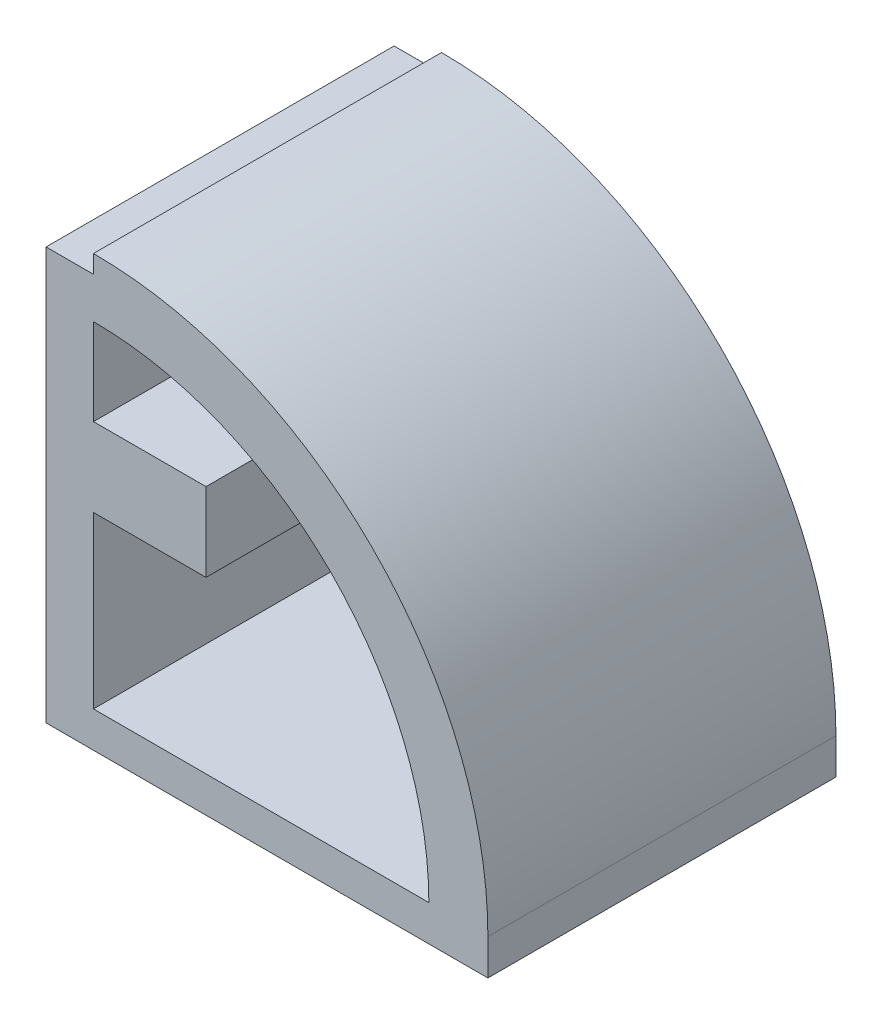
ISO-10303-21;
HEADER;
FILE_DESCRIPTION(('STEP AP214'),'2;1');
FILE_NAME('part.step','',(''),(''),'','','');
FILE_SCHEMA(('AUTOMOTIVE_DESIGN { 1 0 10303 214 1 1 1 1 }'));
ENDSEC;
DATA;
#1=APPLICATION_CONTEXT('core data for automotive mechanical design processes');
#2=APPLICATION_PROTOCOL_DEFINITION('international standard','automotive_design',2000,#1);
#3=PRODUCT_CONTEXT('',#1,'mechanical');
#4=PRODUCT('Part','Part','',(#3));
#5=PRODUCT_RELATED_PRODUCT_CATEGORY('part','',(#4));
#6=PRODUCT_DEFINITION_FORMATION('','',#4);
#7=PRODUCT_DEFINITION_CONTEXT('part definition',#1,'design');
#8=PRODUCT_DEFINITION('design','',#6,#7);
#9=PRODUCT_DEFINITION_SHAPE('','',#8);
#10=(LENGTH_UNIT() NAMED_UNIT(*) SI_UNIT(.MILLI.,.METRE.));
#11=(NAMED_UNIT(*) PLANE_ANGLE_UNIT() SI_UNIT($,.RADIAN.));
#12=(NAMED_UNIT(*) SI_UNIT($,.STERADIAN.) SOLID_ANGLE_UNIT());
#13=UNCERTAINTY_MEASURE_WITH_UNIT(LENGTH_MEASURE(1.E-05),#10,'distance_accuracy_value','');
#14=(GEOMETRIC_REPRESENTATION_CONTEXT(3) GLOBAL_UNCERTAINTY_ASSIGNED_CONTEXT((#13)) GLOBAL_UNIT_ASSIGNED_CONTEXT((#10,
#11,#12)) REPRESENTATION_CONTEXT('',''));
#15=CARTESIAN_POINT('',(0.,0.,0.));
#16=DIRECTION('',(0.,0.,1.));
#17=DIRECTION('',(1.,0.,0.));
#18=AXIS2_PLACEMENT_3D('',#15,#16,#17);
#19=CARTESIAN_POINT('',(18.1175022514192,13.684496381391,66.5));
#20=DIRECTION('',(-1.,0.,0.));
#21=DIRECTION('',(0.,0.,1.));
#22=AXIS2_PLACEMENT_3D('',#19,#20,#21);
#23=PLANE('',#22);
#24=DIRECTION('',(0.,0.,-1.));
#25=VECTOR('',#24,1.);
#26=CARTESIAN_POINT('',(18.1175022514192,141.846369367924,66.5));
#27=LINE('',#26,#25);
#28=CARTESIAN_POINT('',(18.1175022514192,141.846369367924,-66.5));
#29=VERTEX_POINT('',#28);
#30=CARTESIAN_POINT('',(18.1175022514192,141.846369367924,66.5));
#31=VERTEX_POINT('',#30);
#32=EDGE_CURVE('E48',#29,#31,#27,.F.);
#33=ORIENTED_EDGE('',*,*,#32,.T.);
#34=DIRECTION('',(0.,1.,0.));
#35=VECTOR('',#34,1.);
#36=CARTESIAN_POINT('',(18.1175022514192,13.684496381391,66.5));
#37=LINE('',#36,#35);
#38=CARTESIAN_POINT('',(18.1175022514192,108.761947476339,66.5));
#39=VERTEX_POINT('',#38);
#40=EDGE_CURVE('E204',#39,#31,#37,.T.);
#41=ORIENTED_EDGE('',*,*,#40,.F.);
#42=DIRECTION('',(0.,0.,1.));
#43=VECTOR('',#42,1.);
#44=CARTESIAN_POINT('',(18.1175022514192,108.761947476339,66.5));
#45=LINE('',#44,#43);
#46=CARTESIAN_POINT('',(18.1175022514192,108.761947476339,-66.5));
#47=VERTEX_POINT('',#46);
#48=EDGE_CURVE('E170',#47,#39,#45,.T.);
#49=ORIENTED_EDGE('',*,*,#48,.F.);
#50=DIRECTION('',(0.,1.,0.));
#51=VECTOR('',#50,1.);
#52=CARTESIAN_POINT('',(18.1175022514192,13.684496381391,-66.5));
#53=LINE('',#52,#51);
#54=EDGE_CURVE('E218',#47,#29,#53,.T.);
#55=ORIENTED_EDGE('',*,*,#54,.T.);
#56=EDGE_LOOP('',(#33,#41,#49,#55));
#57=FACE_BOUND('',#56,.T.);
#58=ADVANCED_FACE('F33',(#57),#23,.F.);
#59=CARTESIAN_POINT('',(168.839701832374,13.684496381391,66.5));
#60=DIRECTION('',(0.,-1.,0.));
#61=DIRECTION('',(0.,0.,-1.));
#62=AXIS2_PLACEMENT_3D('',#59,#60,#61);
#63=PLANE('',#62);
#64=DIRECTION('',(0.,0.,1.));
#65=VECTOR('',#64,1.);
#66=CARTESIAN_POINT('',(146.279375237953,13.684496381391,66.5));
#67=LINE('',#66,#65);
#68=CARTESIAN_POINT('',(146.279375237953,13.684496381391,-66.5));
#69=VERTEX_POINT('',#68);
#70=CARTESIAN_POINT('',(146.279375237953,13.684496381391,66.5));
#71=VERTEX_POINT('',#70);
#72=EDGE_CURVE('E140',#69,#71,#67,.T.);
#73=ORIENTED_EDGE('',*,*,#72,.F.);
#74=DIRECTION('',(-1.,0.,0.));
#75=VECTOR('',#74,1.);
#76=CARTESIAN_POINT('',(168.839701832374,13.684496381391,-66.5));
#77=LINE('',#76,#75);
#78=CARTESIAN_POINT('',(18.1175022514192,13.684496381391,-66.5));
#79=VERTEX_POINT('',#78);
#80=EDGE_CURVE('E216',#69,#79,#77,.T.);
#81=ORIENTED_EDGE('',*,*,#80,.T.);
#82=DIRECTION('',(0.,0.,-1.));
#83=VECTOR('',#82,1.);
#84=CARTESIAN_POINT('',(18.1175022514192,13.684496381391,66.5));
#85=LINE('',#84,#83);
#86=CARTESIAN_POINT('',(18.1175022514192,13.684496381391,66.5));
#87=VERTEX_POINT('',#86);
#88=EDGE_CURVE('E221',#87,#79,#85,.T.);
#89=ORIENTED_EDGE('',*,*,#88,.F.);
#90=DIRECTION('',(-1.,0.,0.));
#91=VECTOR('',#90,1.);
#92=CARTESIAN_POINT('',(168.839701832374,13.684496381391,66.5));
#93=LINE('',#92,#91);
#94=EDGE_CURVE('E56',#71,#87,#93,.T.);
#95=ORIENTED_EDGE('',*,*,#94,.F.);
#96=EDGE_LOOP('',(#73,#81,#89,#95));
#97=FACE_BOUND('',#96,.T.);
#98=ADVANCED_FACE('F359',(#97),#63,.F.);
#99=DIRECTION('',(0.,0.,-1.));
#100=VECTOR('',#99,1.);
#101=CARTESIAN_POINT('',(18.1175022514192,78.7188677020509,66.5));
#102=LINE('',#101,#100);
#103=CARTESIAN_POINT('',(18.1175022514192,78.7188677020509,66.5));
#104=VERTEX_POINT('',#103);
#105=CARTESIAN_POINT('',(18.1175022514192,78.7188677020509,-66.5));
#106=VERTEX_POINT('',#105);
#107=EDGE_CURVE('E177',#104,#106,#102,.T.);
#108=ORIENTED_EDGE('',*,*,#107,.F.);
#109=EDGE_CURVE('E205',#87,#104,#37,.T.);
#110=ORIENTED_EDGE('',*,*,#109,.F.);
#111=ORIENTED_EDGE('',*,*,#88,.T.);
#112=EDGE_CURVE('E197',#79,#106,#53,.T.);
#113=ORIENTED_EDGE('',*,*,#112,.T.);
#114=EDGE_LOOP('',(#108,#110,#111,#113));
#115=FACE_BOUND('',#114,.T.);
#116=ADVANCED_FACE('F353',(#115),#23,.F.);
#117=CARTESIAN_POINT('',(18.1175022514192,157.514311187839,66.5));
#118=DIRECTION('',(0.,-1.,0.));
#119=DIRECTION('',(0.,0.,-1.));
#120=AXIS2_PLACEMENT_3D('',#117,#118,#119);
#121=PLANE('',#120);
#122=DIRECTION('',(-1.,0.,0.));
#123=VECTOR('',#122,1.);
#124=CARTESIAN_POINT('',(18.1175022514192,157.514311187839,-66.5));
#125=LINE('',#124,#123);
#126=CARTESIAN_POINT('',(18.1175022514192,157.514311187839,-66.5));
#127=VERTEX_POINT('',#126);
#128=CARTESIAN_POINT('',(0.,157.514311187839,-66.5));
#129=VERTEX_POINT('',#128);
#130=EDGE_CURVE('E149',#127,#129,#125,.T.);
#131=ORIENTED_EDGE('',*,*,#130,.T.);
#132=DIRECTION('',(0.,0.,-1.));
#133=VECTOR('',#132,1.);
#134=CARTESIAN_POINT('',(0.,157.514311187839,66.5));
#135=LINE('',#134,#133);
#136=CARTESIAN_POINT('',(0.,157.514311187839,66.5));
#137=VERTEX_POINT('',#136);
#138=EDGE_CURVE('E12',#137,#129,#135,.T.);
#139=ORIENTED_EDGE('',*,*,#138,.F.);
#140=DIRECTION('',(-1.,0.,0.));
#141=VECTOR('',#140,1.);
#142=CARTESIAN_POINT('',(18.1175022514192,157.514311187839,66.5));
#143=LINE('',#142,#141);
#144=CARTESIAN_POINT('',(18.1175022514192,157.514311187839,66.5));
#145=VERTEX_POINT('',#144);
#146=EDGE_CURVE('E193',#145,#137,#143,.T.);
#147=ORIENTED_EDGE('',*,*,#146,.F.);
#148=DIRECTION('',(0.,0.,-1.));
#149=VECTOR('',#148,1.);
#150=CARTESIAN_POINT('',(18.1175022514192,157.514311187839,66.5));
#151=LINE('',#150,#149);
#152=EDGE_CURVE('E208',#145,#127,#151,.T.);
#153=ORIENTED_EDGE('',*,*,#152,.T.);
#154=EDGE_LOOP('',(#131,#139,#147,#153));
#155=FACE_BOUND('',#154,.T.);
#156=ADVANCED_FACE('F35',(#155),#121,.F.);
#157=CARTESIAN_POINT('',(0.,157.514311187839,66.5));
#158=DIRECTION('',(1.,0.,0.));
#159=DIRECTION('',(0.,0.,-1.));
#160=AXIS2_PLACEMENT_3D('',#157,#158,#159);
#161=PLANE('',#160);
#162=DIRECTION('',(0.,-1.,0.));
#163=VECTOR('',#162,1.);
#164=CARTESIAN_POINT('',(0.,157.514311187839,-66.5));
#165=LINE('',#164,#163);
#166=CARTESIAN_POINT('',(0.,0.,-66.5));
#167=VERTEX_POINT('',#166);
#168=EDGE_CURVE('E210',#129,#167,#165,.T.);
#169=ORIENTED_EDGE('',*,*,#168,.T.);
#170=DIRECTION('',(0.,0.,-1.));
#171=VECTOR('',#170,1.);
#172=CARTESIAN_POINT('',(0.,0.,66.5));
#173=LINE('',#172,#171);
#174=CARTESIAN_POINT('',(0.,0.,66.5));
#175=VERTEX_POINT('',#174);
#176=EDGE_CURVE('E41',#175,#167,#173,.T.);
#177=ORIENTED_EDGE('',*,*,#176,.F.);
#178=DIRECTION('',(0.,-1.,0.));
#179=VECTOR('',#178,1.);
#180=CARTESIAN_POINT('',(0.,157.514311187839,66.5));
#181=LINE('',#180,#179);
#182=EDGE_CURVE('E196',#137,#175,#181,.T.);
#183=ORIENTED_EDGE('',*,*,#182,.F.);
#184=ORIENTED_EDGE('',*,*,#138,.T.);
#185=EDGE_LOOP('',(#169,#177,#183,#184));
#186=FACE_BOUND('',#185,.T.);
#187=ADVANCED_FACE('F241',(#186),#161,.F.);
#188=CARTESIAN_POINT('',(0.,0.,66.5));
#189=DIRECTION('',(0.,1.,0.));
#190=DIRECTION('',(0.,0.,1.));
#191=AXIS2_PLACEMENT_3D('',#188,#189,#190);
#192=PLANE('',#191);
#193=DIRECTION('',(1.,0.,0.));
#194=VECTOR('',#193,1.);
#195=CARTESIAN_POINT('',(0.,0.,-66.5));
#196=LINE('',#195,#194);
#197=CARTESIAN_POINT('',(168.839701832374,0.,-66.5));
#198=VERTEX_POINT('',#197);
#199=EDGE_CURVE('E212',#167,#198,#196,.T.);
#200=ORIENTED_EDGE('',*,*,#199,.T.);
#201=DIRECTION('',(0.,0.,-1.));
#202=VECTOR('',#201,1.);
#203=CARTESIAN_POINT('',(168.839701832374,0.,66.5));
#204=LINE('',#203,#202);
#205=CARTESIAN_POINT('',(168.839701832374,0.,66.5));
#206=VERTEX_POINT('',#205);
#207=EDGE_CURVE('E225',#206,#198,#204,.T.);
#208=ORIENTED_EDGE('',*,*,#207,.F.);
#209=DIRECTION('',(1.,0.,0.));
#210=VECTOR('',#209,1.);
#211=CARTESIAN_POINT('',(0.,0.,66.5));
#212=LINE('',#211,#210);
#213=EDGE_CURVE('E199',#175,#206,#212,.T.);
#214=ORIENTED_EDGE('',*,*,#213,.F.);
#215=ORIENTED_EDGE('',*,*,#176,.T.);
#216=EDGE_LOOP('',(#200,#208,#214,#215));
#217=FACE_BOUND('',#216,.T.);
#218=ADVANCED_FACE('F232',(#217),#192,.F.);
#219=CARTESIAN_POINT('',(168.839701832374,0.,66.5));
#220=DIRECTION('',(-1.,0.,0.));
#221=DIRECTION('',(0.,0.,1.));
#222=AXIS2_PLACEMENT_3D('',#219,#220,#221);
#223=PLANE('',#222);
#224=DIRECTION('',(0.,1.,0.));
#225=VECTOR('',#224,1.);
#226=CARTESIAN_POINT('',(168.839701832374,0.,-66.5));
#227=LINE('',#226,#225);
#228=CARTESIAN_POINT('',(168.839701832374,13.684496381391,-66.5));
#229=VERTEX_POINT('',#228);
#230=EDGE_CURVE('E214',#198,#229,#227,.T.);
#231=ORIENTED_EDGE('',*,*,#230,.T.);
#232=DIRECTION('',(0.,0.,-1.));
#233=VECTOR('',#232,1.);
#234=CARTESIAN_POINT('',(168.839701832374,13.684496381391,66.5));
#235=LINE('',#234,#233);
#236=CARTESIAN_POINT('',(168.839701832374,13.684496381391,66.5));
#237=VERTEX_POINT('',#236);
#238=EDGE_CURVE('E154',#237,#229,#235,.T.);
#239=ORIENTED_EDGE('',*,*,#238,.F.);
#240=DIRECTION('',(0.,1.,0.));
#241=VECTOR('',#240,1.);
#242=CARTESIAN_POINT('',(168.839701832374,0.,66.5));
#243=LINE('',#242,#241);
#244=EDGE_CURVE('E201',#206,#237,#243,.T.);
#245=ORIENTED_EDGE('',*,*,#244,.F.);
#246=ORIENTED_EDGE('',*,*,#207,.T.);
#247=EDGE_LOOP('',(#231,#239,#245,#246));
#248=FACE_BOUND('',#247,.T.);
#249=ADVANCED_FACE('F236',(#248),#223,.F.);
#250=CARTESIAN_POINT('',(0.,157.514311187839,66.5));
#251=DIRECTION('',(0.,0.,1.));
#252=DIRECTION('',(1.,0.,0.));
#253=AXIS2_PLACEMENT_3D('',#250,#251,#252);
#254=PLANE('',#253);
#255=CARTESIAN_POINT('',(18.1175022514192,13.684496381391,66.5));
#256=DIRECTION('',(0.,0.,-1.));
#257=DIRECTION('',(-1.,0.,0.));
#258=AXIS2_PLACEMENT_3D('',#255,#256,#257);
#259=CIRCLE('',#258,128.161872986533);
#260=EDGE_CURVE('E155',#31,#71,#259,.T.);
#261=ORIENTED_EDGE('',*,*,#260,.T.);
#262=ORIENTED_EDGE('',*,*,#94,.T.);
#263=ORIENTED_EDGE('',*,*,#109,.T.);
#264=DIRECTION('',(-1.,0.,0.));
#265=VECTOR('',#264,1.);
#266=CARTESIAN_POINT('',(61.1175022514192,78.7188677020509,66.5));
#267=LINE('',#266,#265);
#268=CARTESIAN_POINT('',(61.1175022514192,78.7188677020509,66.5));
#269=VERTEX_POINT('',#268);
#270=EDGE_CURVE('E190',#269,#104,#267,.T.);
#271=ORIENTED_EDGE('',*,*,#270,.F.);
#272=DIRECTION('',(0.,-1.,0.));
#273=VECTOR('',#272,1.);
#274=CARTESIAN_POINT('',(61.1175022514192,108.761947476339,66.5));
#275=LINE('',#274,#273);
#276=CARTESIAN_POINT('',(61.1175022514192,108.761947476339,66.5));
#277=VERTEX_POINT('',#276);
#278=EDGE_CURVE('E166',#277,#269,#275,.T.);
#279=ORIENTED_EDGE('',*,*,#278,.F.);
#280=DIRECTION('',(-1.,0.,0.));
#281=VECTOR('',#280,1.);
#282=CARTESIAN_POINT('',(61.1175022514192,108.761947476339,66.5));
#283=LINE('',#282,#281);
#284=EDGE_CURVE('E176',#277,#39,#283,.T.);
#285=ORIENTED_EDGE('',*,*,#284,.T.);
#286=ORIENTED_EDGE('',*,*,#40,.T.);
#287=EDGE_LOOP('',(#261,#262,#263,#271,#279,#285,#286));
#288=FACE_BOUND('',#287,.T.);
#289=ORIENTED_EDGE('',*,*,#146,.T.);
#290=ORIENTED_EDGE('',*,*,#182,.T.);
#291=ORIENTED_EDGE('',*,*,#213,.T.);
#292=ORIENTED_EDGE('',*,*,#244,.T.);
#293=CARTESIAN_POINT('',(18.1175022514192,13.684496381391,66.5));
#294=DIRECTION('',(0.,0.,-1.));
#295=DIRECTION('',(-1.,0.,0.));
#296=AXIS2_PLACEMENT_3D('',#293,#294,#295);
#297=CIRCLE('',#296,150.722199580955);
#298=CARTESIAN_POINT('',(18.1175022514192,164.406695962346,66.5));
#299=VERTEX_POINT('',#298);
#300=EDGE_CURVE('E156',#299,#237,#297,.T.);
#301=ORIENTED_EDGE('',*,*,#300,.F.);
#302=DIRECTION('',(0.,1.,0.));
#303=VECTOR('',#302,1.);
#304=CARTESIAN_POINT('',(18.1175022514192,13.6818657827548,66.5));
#305=LINE('',#304,#303);
#306=EDGE_CURVE('E135',#145,#299,#305,.T.);
#307=ORIENTED_EDGE('',*,*,#306,.F.);
#308=EDGE_LOOP('',(#289,#290,#291,#292,#301,#307));
#309=FACE_BOUND('',#308,.T.);
#310=ADVANCED_FACE('F239',(#288,#309),#254,.T.);
#311=CARTESIAN_POINT('',(0.,157.514311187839,-66.5));
#312=DIRECTION('',(0.,0.,1.));
#313=DIRECTION('',(1.,0.,0.));
#314=AXIS2_PLACEMENT_3D('',#311,#312,#313);
#315=PLANE('',#314);
#316=ORIENTED_EDGE('',*,*,#80,.F.);
#317=CARTESIAN_POINT('',(18.1175022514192,13.684496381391,-66.5));
#318=DIRECTION('',(0.,0.,-1.));
#319=DIRECTION('',(-1.,0.,0.));
#320=AXIS2_PLACEMENT_3D('',#317,#318,#319);
#321=CIRCLE('',#320,128.161872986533);
#322=EDGE_CURVE('E158',#29,#69,#321,.T.);
#323=ORIENTED_EDGE('',*,*,#322,.F.);
#324=ORIENTED_EDGE('',*,*,#54,.F.);
#325=DIRECTION('',(-1.,0.,0.));
#326=VECTOR('',#325,1.);
#327=CARTESIAN_POINT('',(61.1175022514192,108.761947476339,-66.5));
#328=LINE('',#327,#326);
#329=CARTESIAN_POINT('',(61.1175022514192,108.761947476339,-66.5));
#330=VERTEX_POINT('',#329);
#331=EDGE_CURVE('E184',#330,#47,#328,.T.);
#332=ORIENTED_EDGE('',*,*,#331,.F.);
#333=DIRECTION('',(0.,1.,0.));
#334=VECTOR('',#333,1.);
#335=CARTESIAN_POINT('',(61.1175022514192,108.761947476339,-66.5));
#336=LINE('',#335,#334);
#337=CARTESIAN_POINT('',(61.1175022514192,78.7188677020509,-66.5));
#338=VERTEX_POINT('',#337);
#339=EDGE_CURVE('E172',#338,#330,#336,.T.);
#340=ORIENTED_EDGE('',*,*,#339,.F.);
#341=DIRECTION('',(-1.,0.,0.));
#342=VECTOR('',#341,1.);
#343=CARTESIAN_POINT('',(61.1175022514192,78.7188677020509,-66.5));
#344=LINE('',#343,#342);
#345=EDGE_CURVE('E187',#338,#106,#344,.T.);
#346=ORIENTED_EDGE('',*,*,#345,.T.);
#347=ORIENTED_EDGE('',*,*,#112,.F.);
#348=EDGE_LOOP('',(#316,#323,#324,#332,#340,#346,#347));
#349=FACE_BOUND('',#348,.T.);
#350=ORIENTED_EDGE('',*,*,#130,.F.);
#351=DIRECTION('',(0.,-1.,0.));
#352=VECTOR('',#351,1.);
#353=CARTESIAN_POINT('',(18.1175022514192,13.6818657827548,-66.5));
#354=LINE('',#353,#352);
#355=CARTESIAN_POINT('',(18.1175022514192,164.406695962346,-66.5));
#356=VERTEX_POINT('',#355);
#357=EDGE_CURVE('E133',#356,#127,#354,.T.);
#358=ORIENTED_EDGE('',*,*,#357,.F.);
#359=CARTESIAN_POINT('',(18.1175022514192,13.684496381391,-66.5));
#360=DIRECTION('',(0.,0.,-1.));
#361=DIRECTION('',(-1.,0.,0.));
#362=AXIS2_PLACEMENT_3D('',#359,#360,#361);
#363=CIRCLE('',#362,150.722199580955);
#364=EDGE_CURVE('E146',#356,#229,#363,.T.);
#365=ORIENTED_EDGE('',*,*,#364,.T.);
#366=ORIENTED_EDGE('',*,*,#230,.F.);
#367=ORIENTED_EDGE('',*,*,#199,.F.);
#368=ORIENTED_EDGE('',*,*,#168,.F.);
#369=EDGE_LOOP('',(#350,#358,#365,#366,#367,#368));
#370=FACE_BOUND('',#369,.T.);
#371=ADVANCED_FACE('F144',(#349,#370),#315,.F.);
#372=CARTESIAN_POINT('',(61.1175022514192,78.7188677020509,66.5));
#373=DIRECTION('',(0.,1.,0.));
#374=DIRECTION('',(0.,0.,1.));
#375=AXIS2_PLACEMENT_3D('',#372,#373,#374);
#376=PLANE('',#375);
#377=ORIENTED_EDGE('',*,*,#107,.T.);
#378=ORIENTED_EDGE('',*,*,#345,.F.);
#379=DIRECTION('',(0.,0.,-1.));
#380=VECTOR('',#379,1.);
#381=CARTESIAN_POINT('',(61.1175022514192,78.7188677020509,66.5));
#382=LINE('',#381,#380);
#383=EDGE_CURVE('E169',#269,#338,#382,.T.);
#384=ORIENTED_EDGE('',*,*,#383,.F.);
#385=ORIENTED_EDGE('',*,*,#270,.T.);
#386=EDGE_LOOP('',(#377,#378,#384,#385));
#387=FACE_BOUND('',#386,.T.);
#388=ADVANCED_FACE('F275',(#387),#376,.F.);
#389=CARTESIAN_POINT('',(61.1175022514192,108.761947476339,66.5));
#390=DIRECTION('',(0.,-1.,0.));
#391=DIRECTION('',(0.,0.,-1.));
#392=AXIS2_PLACEMENT_3D('',#389,#390,#391);
#393=PLANE('',#392);
#394=ORIENTED_EDGE('',*,*,#48,.T.);
#395=ORIENTED_EDGE('',*,*,#284,.F.);
#396=DIRECTION('',(0.,0.,1.));
#397=VECTOR('',#396,1.);
#398=CARTESIAN_POINT('',(61.1175022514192,108.761947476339,66.5));
#399=LINE('',#398,#397);
#400=EDGE_CURVE('E174',#330,#277,#399,.T.);
#401=ORIENTED_EDGE('',*,*,#400,.F.);
#402=ORIENTED_EDGE('',*,*,#331,.T.);
#403=EDGE_LOOP('',(#394,#395,#401,#402));
#404=FACE_BOUND('',#403,.T.);
#405=ADVANCED_FACE('F313',(#404),#393,.F.);
#406=CARTESIAN_POINT('',(61.1175022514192,78.7188677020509,66.5));
#407=DIRECTION('',(1.,0.,0.));
#408=DIRECTION('',(0.,0.,-1.));
#409=AXIS2_PLACEMENT_3D('',#406,#407,#408);
#410=PLANE('',#409);
#411=ORIENTED_EDGE('',*,*,#278,.T.);
#412=ORIENTED_EDGE('',*,*,#383,.T.);
#413=ORIENTED_EDGE('',*,*,#339,.T.);
#414=ORIENTED_EDGE('',*,*,#400,.T.);
#415=EDGE_LOOP('',(#411,#412,#413,#414));
#416=FACE_BOUND('',#415,.T.);
#417=ADVANCED_FACE('F288',(#416),#410,.T.);
#418=CARTESIAN_POINT('',(18.1175022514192,13.684496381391,66.5));
#419=DIRECTION('',(-1.,0.,0.));
#420=DIRECTION('',(0.,0.,1.));
#421=AXIS2_PLACEMENT_3D('',#418,#419,#420);
#422=PLANE('',#421);
#423=ORIENTED_EDGE('',*,*,#152,.F.);
#424=ORIENTED_EDGE('',*,*,#306,.T.);
#425=DIRECTION('',(0.,0.,-1.));
#426=VECTOR('',#425,1.);
#427=CARTESIAN_POINT('',(18.1175022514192,164.406695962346,66.5));
#428=LINE('',#427,#426);
#429=EDGE_CURVE('E129',#299,#356,#428,.T.);
#430=ORIENTED_EDGE('',*,*,#429,.T.);
#431=ORIENTED_EDGE('',*,*,#357,.T.);
#432=EDGE_LOOP('',(#423,#424,#430,#431));
#433=FACE_BOUND('',#432,.T.);
#434=ADVANCED_FACE('F132',(#433),#422,.T.);
#435=CARTESIAN_POINT('',(18.1175022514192,13.684496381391,66.5));
#436=DIRECTION('',(0.,0.,-1.));
#437=DIRECTION('',(-1.,0.,0.));
#438=AXIS2_PLACEMENT_3D('',#435,#436,#437);
#439=CYLINDRICAL_SURFACE('',#438,150.722199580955);
#440=ORIENTED_EDGE('',*,*,#429,.F.);
#441=ORIENTED_EDGE('',*,*,#300,.T.);
#442=ORIENTED_EDGE('',*,*,#238,.T.);
#443=ORIENTED_EDGE('',*,*,#364,.F.);
#444=EDGE_LOOP('',(#440,#441,#442,#443));
#445=FACE_BOUND('',#444,.T.);
#446=ADVANCED_FACE('F152',(#445),#439,.T.);
#447=CARTESIAN_POINT('',(18.1175022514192,13.684496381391,66.5));
#448=DIRECTION('',(0.,0.,-1.));
#449=DIRECTION('',(-1.,0.,0.));
#450=AXIS2_PLACEMENT_3D('',#447,#448,#449);
#451=CYLINDRICAL_SURFACE('',#450,128.161872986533);
#452=ORIENTED_EDGE('',*,*,#32,.F.);
#453=ORIENTED_EDGE('',*,*,#322,.T.);
#454=ORIENTED_EDGE('',*,*,#72,.T.);
#455=ORIENTED_EDGE('',*,*,#260,.F.);
#456=EDGE_LOOP('',(#452,#453,#454,#455));
#457=FACE_BOUND('',#456,.T.);
#458=ADVANCED_FACE('F296',(#457),#451,.F.);
#459=CLOSED_SHELL('',(#58,#98,#116,#156,#187,#218,#249,#310,#371,#388,#405,#417,#434,#446,#458));
#460=MANIFOLD_SOLID_BREP('B2',#459);
#461=ADVANCED_BREP_SHAPE_REPRESENTATION('',(#18,#460),#14);
#462=SHAPE_DEFINITION_REPRESENTATION(#9,#461);
ENDSEC;
END-ISO-10303-21;
